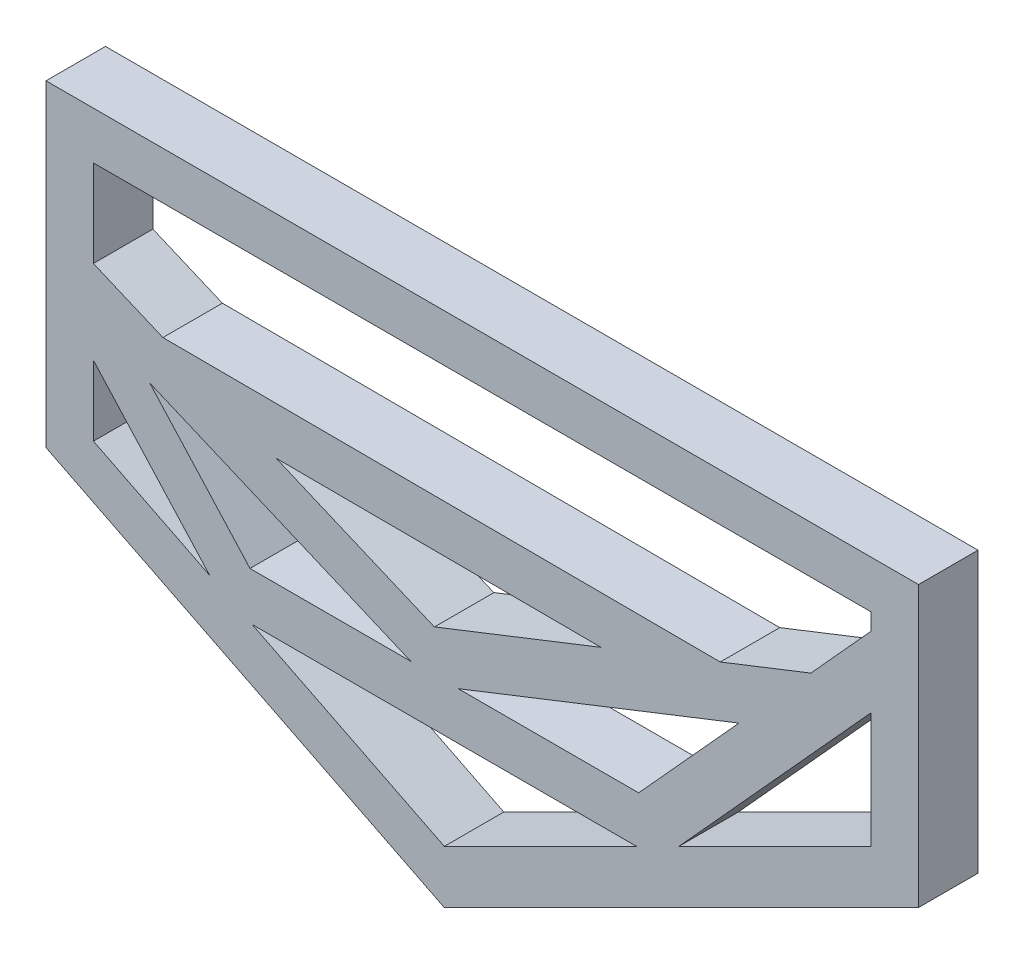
ISO-10303-21;
HEADER;
FILE_DESCRIPTION(('STEP AP214'),'2;1');
FILE_NAME('part.step','',(''),(''),'','','');
FILE_SCHEMA(('AUTOMOTIVE_DESIGN { 1 0 10303 214 1 1 1 1 }'));
ENDSEC;
DATA;
#1=APPLICATION_CONTEXT('core data for automotive mechanical design processes');
#2=APPLICATION_PROTOCOL_DEFINITION('international standard','automotive_design',2000,#1);
#3=PRODUCT_CONTEXT('',#1,'mechanical');
#4=PRODUCT('Part','Part','',(#3));
#5=PRODUCT_RELATED_PRODUCT_CATEGORY('part','',(#4));
#6=PRODUCT_DEFINITION_FORMATION('','',#4);
#7=PRODUCT_DEFINITION_CONTEXT('part definition',#1,'design');
#8=PRODUCT_DEFINITION('design','',#6,#7);
#9=PRODUCT_DEFINITION_SHAPE('','',#8);
#10=(LENGTH_UNIT() NAMED_UNIT(*) SI_UNIT(.MILLI.,.METRE.));
#11=(NAMED_UNIT(*) PLANE_ANGLE_UNIT() SI_UNIT($,.RADIAN.));
#12=(NAMED_UNIT(*) SI_UNIT($,.STERADIAN.) SOLID_ANGLE_UNIT());
#13=UNCERTAINTY_MEASURE_WITH_UNIT(LENGTH_MEASURE(1.E-05),#10,'distance_accuracy_value','');
#14=(GEOMETRIC_REPRESENTATION_CONTEXT(3) GLOBAL_UNCERTAINTY_ASSIGNED_CONTEXT((#13)) GLOBAL_UNIT_ASSIGNED_CONTEXT((#10,
#11,#12)) REPRESENTATION_CONTEXT('',''));
#15=CARTESIAN_POINT('',(0.,0.,0.));
#16=DIRECTION('',(0.,0.,1.));
#17=DIRECTION('',(1.,0.,0.));
#18=AXIS2_PLACEMENT_3D('',#15,#16,#17);
#19=CARTESIAN_POINT('',(0.,0.,19.));
#20=DIRECTION('',(0.,0.,-1.));
#21=DIRECTION('',(-1.,0.,0.));
#22=AXIS2_PLACEMENT_3D('',#19,#20,#21);
#23=PLANE('',#22);
#24=DIRECTION('',(0.671904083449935,-0.740638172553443,0.));
#25=VECTOR('',#24,1.);
#26=CARTESIAN_POINT('',(-49.8871765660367,53.1441461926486,19.));
#27=LINE('',#26,#25);
#28=CARTESIAN_POINT('',(-49.8871765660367,53.1441461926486,19.));
#29=VERTEX_POINT('',#28);
#30=CARTESIAN_POINT('',(-17.8631863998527,17.844182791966,19.));
#31=VERTEX_POINT('',#30);
#32=EDGE_CURVE('E265',#29,#31,#27,.T.);
#33=ORIENTED_EDGE('',*,*,#32,.F.);
#34=DIRECTION('',(-0.920875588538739,0.389856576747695,0.));
#35=VECTOR('',#34,1.);
#36=CARTESIAN_POINT('',(-49.8871765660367,53.1441461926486,19.));
#37=LINE('',#36,#35);
#38=CARTESIAN_POINT('',(33.4944476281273,17.8441827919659,19.));
#39=VERTEX_POINT('',#38);
#40=EDGE_CURVE('E271',#39,#29,#37,.T.);
#41=ORIENTED_EDGE('',*,*,#40,.F.);
#42=DIRECTION('',(1.,0.,0.));
#43=VECTOR('',#42,1.);
#44=CARTESIAN_POINT('',(-17.8631863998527,17.844182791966,19.));
#45=LINE('',#44,#43);
#46=EDGE_CURVE('E267',#31,#39,#45,.T.);
#47=ORIENTED_EDGE('',*,*,#46,.F.);
#48=EDGE_LOOP('',(#33,#41,#47));
#49=FACE_BOUND('',#48,.T.);
#50=DIRECTION('',(0.894427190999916,-0.447213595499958,0.));
#51=VECTOR('',#50,1.);
#52=CARTESIAN_POINT('',(-17.1707653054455,2.70132559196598,19.));
#53=LINE('',#52,#51);
#54=CARTESIAN_POINT('',(-17.1707653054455,2.70132559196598,19.));
#55=VERTEX_POINT('',#54);
#56=CARTESIAN_POINT('',(44.2000004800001,-27.9840573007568,19.));
#57=VERTEX_POINT('',#56);
#58=EDGE_CURVE('E320',#55,#57,#53,.T.);
#59=ORIENTED_EDGE('',*,*,#58,.F.);
#60=DIRECTION('',(-1.,0.,0.));
#61=VECTOR('',#60,1.);
#62=CARTESIAN_POINT('',(-17.1707653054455,2.70132559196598,19.));
#63=LINE('',#62,#61);
#64=CARTESIAN_POINT('',(105.570766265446,2.70132559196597,19.));
#65=VERTEX_POINT('',#64);
#66=EDGE_CURVE('E326',#65,#55,#63,.T.);
#67=ORIENTED_EDGE('',*,*,#66,.F.);
#68=DIRECTION('',(0.894427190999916,0.447213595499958,0.));
#69=VECTOR('',#68,1.);
#70=CARTESIAN_POINT('',(44.2000004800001,-27.9840573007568,19.));
#71=LINE('',#70,#69);
#72=EDGE_CURVE('E322',#57,#65,#71,.T.);
#73=ORIENTED_EDGE('',*,*,#72,.F.);
#74=EDGE_LOOP('',(#59,#67,#73));
#75=FACE_BOUND('',#74,.T.);
#76=DIRECTION('',(-0.671904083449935,0.740638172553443,0.));
#77=VECTOR('',#76,1.);
#78=CARTESIAN_POINT('',(-67.8571427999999,50.4151640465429,19.));
#79=LINE('',#78,#77);
#80=CARTESIAN_POINT('',(-30.7149485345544,9.47341720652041,19.));
#81=VERTEX_POINT('',#80);
#82=CARTESIAN_POINT('',(-67.8571427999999,50.4151640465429,19.));
#83=VERTEX_POINT('',#82);
#84=EDGE_CURVE('E368',#81,#83,#79,.T.);
#85=ORIENTED_EDGE('',*,*,#84,.F.);
#86=DIRECTION('',(0.894427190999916,-0.447213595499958,0.));
#87=VECTOR('',#86,1.);
#88=CARTESIAN_POINT('',(-67.8571427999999,28.0445143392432,19.));
#89=LINE('',#88,#87);
#90=CARTESIAN_POINT('',(-67.8571427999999,28.0445143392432,19.));
#91=VERTEX_POINT('',#90);
#92=EDGE_CURVE('E374',#91,#81,#89,.T.);
#93=ORIENTED_EDGE('',*,*,#92,.F.);
#94=DIRECTION('',(0.,-1.,0.));
#95=VECTOR('',#94,1.);
#96=CARTESIAN_POINT('',(-67.8571427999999,50.4151640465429,19.));
#97=LINE('',#96,#95);
#98=EDGE_CURVE('E370',#83,#91,#97,.T.);
#99=ORIENTED_EDGE('',*,*,#98,.F.);
#100=EDGE_LOOP('',(#85,#93,#99));
#101=FACE_BOUND('',#100,.T.);
#102=DIRECTION('',(-1.,0.,0.));
#103=VECTOR('',#102,1.);
#104=CARTESIAN_POINT('',(-82.9999999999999,120.142857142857,19.));
#105=LINE('',#104,#103);
#106=CARTESIAN_POINT('',(195.62857248,120.142857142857,19.));
#107=VERTEX_POINT('',#106);
#108=CARTESIAN_POINT('',(-82.9999999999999,120.142857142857,19.));
#109=VERTEX_POINT('',#108);
#110=EDGE_CURVE('E444',#107,#109,#105,.T.);
#111=ORIENTED_EDGE('',*,*,#110,.T.);
#112=DIRECTION('',(0.,-1.,0.));
#113=VECTOR('',#112,1.);
#114=CARTESIAN_POINT('',(-82.9999999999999,120.142857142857,19.));
#115=LINE('',#114,#113);
#116=CARTESIAN_POINT('',(-82.9999999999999,18.6857139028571,19.));
#117=VERTEX_POINT('',#116);
#118=EDGE_CURVE('E447',#109,#117,#115,.T.);
#119=ORIENTED_EDGE('',*,*,#118,.T.);
#120=DIRECTION('',(0.894427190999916,-0.447213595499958,0.));
#121=VECTOR('',#120,1.);
#122=CARTESIAN_POINT('',(-82.9999999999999,18.6857139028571,19.));
#123=LINE('',#122,#121);
#124=CARTESIAN_POINT('',(44.2000004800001,-44.9142863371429,19.));
#125=VERTEX_POINT('',#124);
#126=EDGE_CURVE('E450',#117,#125,#123,.T.);
#127=ORIENTED_EDGE('',*,*,#126,.T.);
#128=DIRECTION('',(0.894427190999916,0.447213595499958,0.));
#129=VECTOR('',#128,1.);
#130=CARTESIAN_POINT('',(44.2000004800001,-44.9142863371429,19.));
#131=LINE('',#130,#129);
#132=CARTESIAN_POINT('',(195.62857248,30.7999996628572,19.));
#133=VERTEX_POINT('',#132);
#134=EDGE_CURVE('E452',#125,#133,#131,.T.);
#135=ORIENTED_EDGE('',*,*,#134,.T.);
#136=DIRECTION('',(0.,1.,0.));
#137=VECTOR('',#136,1.);
#138=CARTESIAN_POINT('',(195.62857248,120.142857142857,19.));
#139=LINE('',#138,#137);
#140=EDGE_CURVE('E454',#133,#107,#139,.T.);
#141=ORIENTED_EDGE('',*,*,#140,.T.);
#142=EDGE_LOOP('',(#111,#119,#127,#135,#141));
#143=FACE_BOUND('',#142,.T.);
#144=DIRECTION('',(-1.,0.,0.));
#145=VECTOR('',#144,1.);
#146=CARTESIAN_POINT('',(-67.8571427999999,104.999999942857,19.));
#147=LINE('',#146,#145);
#148=CARTESIAN_POINT('',(180.48571528,104.999999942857,19.));
#149=VERTEX_POINT('',#148);
#150=CARTESIAN_POINT('',(-67.8571427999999,104.999999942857,19.));
#151=VERTEX_POINT('',#150);
#152=EDGE_CURVE('E392',#149,#151,#147,.T.);
#153=ORIENTED_EDGE('',*,*,#152,.F.);
#154=DIRECTION('',(0.,1.,0.));
#155=VECTOR('',#154,1.);
#156=CARTESIAN_POINT('',(180.48571528,104.999999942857,19.));
#157=LINE('',#156,#155);
#158=CARTESIAN_POINT('',(180.48571528,99.659487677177,19.));
#159=VERTEX_POINT('',#158);
#160=EDGE_CURVE('E406',#159,#149,#157,.T.);
#161=ORIENTED_EDGE('',*,*,#160,.F.);
#162=DIRECTION('',(0.671904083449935,0.740638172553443,0.));
#163=VECTOR('',#162,1.);
#164=CARTESIAN_POINT('',(161.256065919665,78.4626938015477,19.));
#165=LINE('',#164,#163);
#166=CARTESIAN_POINT('',(161.256065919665,78.4626938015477,19.));
#167=VERTEX_POINT('',#166);
#168=EDGE_CURVE('E403',#167,#159,#165,.T.);
#169=ORIENTED_EDGE('',*,*,#168,.F.);
#170=DIRECTION('',(0.930467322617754,0.366374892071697,0.));
#171=VECTOR('',#170,1.);
#172=CARTESIAN_POINT('',(132.322852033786,67.0701356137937,19.));
#173=LINE('',#172,#171);
#174=CARTESIAN_POINT('',(132.322852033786,67.0701356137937,19.));
#175=VERTEX_POINT('',#174);
#176=EDGE_CURVE('E401',#175,#167,#173,.T.);
#177=ORIENTED_EDGE('',*,*,#176,.F.);
#178=DIRECTION('',(0.999991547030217,-0.00411167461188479,0.));
#179=VECTOR('',#178,1.);
#180=CARTESIAN_POINT('',(-45.6681552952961,67.8019829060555,19.));
#181=LINE('',#180,#179);
#182=CARTESIAN_POINT('',(-45.6681552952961,67.8019829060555,19.));
#183=VERTEX_POINT('',#182);
#184=EDGE_CURVE('E399',#183,#175,#181,.T.);
#185=ORIENTED_EDGE('',*,*,#184,.F.);
#186=DIRECTION('',(0.920875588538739,-0.389856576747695,0.));
#187=VECTOR('',#186,1.);
#188=CARTESIAN_POINT('',(-67.8571427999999,77.195784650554,19.));
#189=LINE('',#188,#187);
#190=CARTESIAN_POINT('',(-67.8571427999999,77.195784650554,19.));
#191=VERTEX_POINT('',#190);
#192=EDGE_CURVE('E397',#191,#183,#189,.T.);
#193=ORIENTED_EDGE('',*,*,#192,.F.);
#194=DIRECTION('',(0.,-1.,0.));
#195=VECTOR('',#194,1.);
#196=CARTESIAN_POINT('',(-67.8571427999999,104.999999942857,19.));
#197=LINE('',#196,#195);
#198=EDGE_CURVE('E394',#151,#191,#197,.T.);
#199=ORIENTED_EDGE('',*,*,#198,.F.);
#200=EDGE_LOOP('',(#153,#161,#169,#177,#185,#193,#199));
#201=FACE_BOUND('',#200,.T.);
#202=DIRECTION('',(0.,1.,0.));
#203=VECTOR('',#202,1.);
#204=CARTESIAN_POINT('',(180.48571528,77.1222571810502,19.));
#205=LINE('',#204,#203);
#206=CARTESIAN_POINT('',(180.48571528,40.1588000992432,19.));
#207=VERTEX_POINT('',#206);
#208=CARTESIAN_POINT('',(180.48571528,77.1222571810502,19.));
#209=VERTEX_POINT('',#208);
#210=EDGE_CURVE('E344',#207,#209,#205,.T.);
#211=ORIENTED_EDGE('',*,*,#210,.F.);
#212=DIRECTION('',(0.894427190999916,0.447213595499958,0.));
#213=VECTOR('',#212,1.);
#214=CARTESIAN_POINT('',(119.114949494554,9.47341720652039,19.));
#215=LINE('',#214,#213);
#216=CARTESIAN_POINT('',(119.114949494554,9.47341720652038,19.));
#217=VERTEX_POINT('',#216);
#218=EDGE_CURVE('E350',#217,#207,#215,.T.);
#219=ORIENTED_EDGE('',*,*,#218,.F.);
#220=DIRECTION('',(-0.671904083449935,-0.740638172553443,0.));
#221=VECTOR('',#220,1.);
#222=CARTESIAN_POINT('',(119.114949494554,9.47341720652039,19.));
#223=LINE('',#222,#221);
#224=EDGE_CURVE('E346',#209,#217,#223,.T.);
#225=ORIENTED_EDGE('',*,*,#224,.F.);
#226=EDGE_LOOP('',(#211,#219,#225));
#227=FACE_BOUND('',#226,.T.);
#228=DIRECTION('',(0.930467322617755,0.366374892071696,0.));
#229=VECTOR('',#228,1.);
#230=CARTESIAN_POINT('',(41.0658762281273,31.1373695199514,19.));
#231=LINE('',#230,#229);
#232=CARTESIAN_POINT('',(41.0658762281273,31.1373695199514,19.));
#233=VERTEX_POINT('',#232);
#234=CARTESIAN_POINT('',(94.2622736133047,52.0836444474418,19.));
#235=VERTEX_POINT('',#234);
#236=EDGE_CURVE('E289',#233,#235,#231,.T.);
#237=ORIENTED_EDGE('',*,*,#236,.F.);
#238=DIRECTION('',(-2.54144745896E-13,1.,0.));
#239=VECTOR('',#238,1.);
#240=CARTESIAN_POINT('',(41.0658762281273,31.1373695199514,19.));
#241=LINE('',#240,#239);
#242=CARTESIAN_POINT('',(41.0658762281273,31.0827636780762,19.));
#243=VERTEX_POINT('',#242);
#244=EDGE_CURVE('E297',#243,#233,#241,.T.);
#245=ORIENTED_EDGE('',*,*,#244,.F.);
#246=DIRECTION('',(0.920875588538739,-0.389856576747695,0.));
#247=VECTOR('',#246,1.);
#248=CARTESIAN_POINT('',(-9.54828572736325,52.5104832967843,19.));
#249=LINE('',#248,#247);
#250=CARTESIAN_POINT('',(-9.54828572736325,52.5104832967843,19.));
#251=VERTEX_POINT('',#250);
#252=EDGE_CURVE('E294',#251,#243,#249,.T.);
#253=ORIENTED_EDGE('',*,*,#252,.F.);
#254=DIRECTION('',(-0.999991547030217,0.00411167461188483,0.));
#255=VECTOR('',#254,1.);
#256=CARTESIAN_POINT('',(-9.54828572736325,52.5104832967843,19.));
#257=LINE('',#256,#255);
#258=EDGE_CURVE('E291',#235,#251,#257,.T.);
#259=ORIENTED_EDGE('',*,*,#258,.F.);
#260=EDGE_LOOP('',(#237,#245,#253,#259));
#261=FACE_BOUND('',#260,.T.);
#262=DIRECTION('',(1.,0.,0.));
#263=VECTOR('',#262,1.);
#264=CARTESIAN_POINT('',(48.6373048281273,17.844182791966,19.));
#265=LINE('',#264,#263);
#266=CARTESIAN_POINT('',(48.6373048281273,17.844182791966,19.));
#267=VERTEX_POINT('',#266);
#268=CARTESIAN_POINT('',(106.263187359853,17.844182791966,19.));
#269=VERTEX_POINT('',#268);
#270=EDGE_CURVE('E238',#267,#269,#265,.T.);
#271=ORIENTED_EDGE('',*,*,#270,.F.);
#272=DIRECTION('',(-0.930467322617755,-0.366374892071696,0.));
#273=VECTOR('',#272,1.);
#274=CARTESIAN_POINT('',(48.6373048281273,17.844182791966,19.));
#275=LINE('',#274,#273);
#276=CARTESIAN_POINT('',(138.287177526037,53.1441461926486,19.));
#277=VERTEX_POINT('',#276);
#278=EDGE_CURVE('E255',#277,#267,#275,.T.);
#279=ORIENTED_EDGE('',*,*,#278,.F.);
#280=DIRECTION('',(0.671904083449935,0.740638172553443,0.));
#281=VECTOR('',#280,1.);
#282=CARTESIAN_POINT('',(106.263187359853,17.844182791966,19.));
#283=LINE('',#282,#281);
#284=EDGE_CURVE('E246',#269,#277,#283,.T.);
#285=ORIENTED_EDGE('',*,*,#284,.F.);
#286=EDGE_LOOP('',(#271,#279,#285));
#287=FACE_BOUND('',#286,.T.);
#288=ADVANCED_FACE('F35',(#49,#75,#101,#143,#201,#227,#261,#287),#23,.F.);
#289=CARTESIAN_POINT('',(0.,0.,0.));
#290=DIRECTION('',(0.,0.,-1.));
#291=DIRECTION('',(-1.,0.,0.));
#292=AXIS2_PLACEMENT_3D('',#289,#290,#291);
#293=PLANE('',#292);
#294=DIRECTION('',(-1.,0.,0.));
#295=VECTOR('',#294,1.);
#296=CARTESIAN_POINT('',(-82.9999999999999,120.142857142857,0.));
#297=LINE('',#296,#295);
#298=CARTESIAN_POINT('',(195.62857248,120.142857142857,0.));
#299=VERTEX_POINT('',#298);
#300=CARTESIAN_POINT('',(-82.9999999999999,120.142857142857,0.));
#301=VERTEX_POINT('',#300);
#302=EDGE_CURVE('E443',#299,#301,#297,.T.);
#303=ORIENTED_EDGE('',*,*,#302,.F.);
#304=DIRECTION('',(0.,1.,0.));
#305=VECTOR('',#304,1.);
#306=CARTESIAN_POINT('',(195.62857248,120.142857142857,0.));
#307=LINE('',#306,#305);
#308=CARTESIAN_POINT('',(195.62857248,30.7999996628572,0.));
#309=VERTEX_POINT('',#308);
#310=EDGE_CURVE('E448',#309,#299,#307,.T.);
#311=ORIENTED_EDGE('',*,*,#310,.F.);
#312=DIRECTION('',(0.894427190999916,0.447213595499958,0.));
#313=VECTOR('',#312,1.);
#314=CARTESIAN_POINT('',(44.2000004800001,-44.9142863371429,0.));
#315=LINE('',#314,#313);
#316=CARTESIAN_POINT('',(44.2000004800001,-44.9142863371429,0.));
#317=VERTEX_POINT('',#316);
#318=EDGE_CURVE('E463',#317,#309,#315,.T.);
#319=ORIENTED_EDGE('',*,*,#318,.F.);
#320=DIRECTION('',(0.894427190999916,-0.447213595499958,0.));
#321=VECTOR('',#320,1.);
#322=CARTESIAN_POINT('',(-82.9999999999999,18.6857139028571,0.));
#323=LINE('',#322,#321);
#324=CARTESIAN_POINT('',(-82.9999999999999,18.6857139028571,0.));
#325=VERTEX_POINT('',#324);
#326=EDGE_CURVE('E461',#325,#317,#323,.T.);
#327=ORIENTED_EDGE('',*,*,#326,.F.);
#328=DIRECTION('',(0.,-1.,0.));
#329=VECTOR('',#328,1.);
#330=CARTESIAN_POINT('',(-82.9999999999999,120.142857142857,0.));
#331=LINE('',#330,#329);
#332=EDGE_CURVE('E459',#301,#325,#331,.T.);
#333=ORIENTED_EDGE('',*,*,#332,.F.);
#334=EDGE_LOOP('',(#303,#311,#319,#327,#333));
#335=FACE_BOUND('',#334,.T.);
#336=DIRECTION('',(0.,1.,0.));
#337=VECTOR('',#336,1.);
#338=CARTESIAN_POINT('',(180.48571528,104.999999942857,0.));
#339=LINE('',#338,#337);
#340=CARTESIAN_POINT('',(180.48571528,99.659487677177,0.));
#341=VERTEX_POINT('',#340);
#342=CARTESIAN_POINT('',(180.48571528,104.999999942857,0.));
#343=VERTEX_POINT('',#342);
#344=EDGE_CURVE('E395',#341,#343,#339,.T.);
#345=ORIENTED_EDGE('',*,*,#344,.T.);
#346=DIRECTION('',(-1.,0.,0.));
#347=VECTOR('',#346,1.);
#348=CARTESIAN_POINT('',(-67.8571427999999,104.999999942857,0.));
#349=LINE('',#348,#347);
#350=CARTESIAN_POINT('',(-67.8571427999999,104.999999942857,0.));
#351=VERTEX_POINT('',#350);
#352=EDGE_CURVE('E391',#343,#351,#349,.T.);
#353=ORIENTED_EDGE('',*,*,#352,.T.);
#354=DIRECTION('',(0.,-1.,0.));
#355=VECTOR('',#354,1.);
#356=CARTESIAN_POINT('',(-67.8571427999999,104.999999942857,0.));
#357=LINE('',#356,#355);
#358=CARTESIAN_POINT('',(-67.8571427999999,77.195784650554,0.));
#359=VERTEX_POINT('',#358);
#360=EDGE_CURVE('E411',#351,#359,#357,.T.);
#361=ORIENTED_EDGE('',*,*,#360,.T.);
#362=DIRECTION('',(0.920875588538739,-0.389856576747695,0.));
#363=VECTOR('',#362,1.);
#364=CARTESIAN_POINT('',(-67.8571427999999,77.195784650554,0.));
#365=LINE('',#364,#363);
#366=CARTESIAN_POINT('',(-45.6681552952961,67.8019829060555,0.));
#367=VERTEX_POINT('',#366);
#368=EDGE_CURVE('E414',#359,#367,#365,.T.);
#369=ORIENTED_EDGE('',*,*,#368,.T.);
#370=DIRECTION('',(0.999991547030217,-0.00411167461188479,0.));
#371=VECTOR('',#370,1.);
#372=CARTESIAN_POINT('',(-45.6681552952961,67.8019829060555,0.));
#373=LINE('',#372,#371);
#374=CARTESIAN_POINT('',(132.322852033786,67.0701356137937,0.));
#375=VERTEX_POINT('',#374);
#376=EDGE_CURVE('E417',#367,#375,#373,.T.);
#377=ORIENTED_EDGE('',*,*,#376,.T.);
#378=DIRECTION('',(0.930467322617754,0.366374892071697,0.));
#379=VECTOR('',#378,1.);
#380=CARTESIAN_POINT('',(132.322852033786,67.0701356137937,0.));
#381=LINE('',#380,#379);
#382=CARTESIAN_POINT('',(161.256065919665,78.4626938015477,0.));
#383=VERTEX_POINT('',#382);
#384=EDGE_CURVE('E420',#375,#383,#381,.T.);
#385=ORIENTED_EDGE('',*,*,#384,.T.);
#386=DIRECTION('',(0.671904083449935,0.740638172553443,0.));
#387=VECTOR('',#386,1.);
#388=CARTESIAN_POINT('',(161.256065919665,78.4626938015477,0.));
#389=LINE('',#388,#387);
#390=EDGE_CURVE('E423',#383,#341,#389,.T.);
#391=ORIENTED_EDGE('',*,*,#390,.T.);
#392=EDGE_LOOP('',(#345,#353,#361,#369,#377,#385,#391));
#393=FACE_BOUND('',#392,.T.);
#394=DIRECTION('',(0.894427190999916,-0.447213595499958,0.));
#395=VECTOR('',#394,1.);
#396=CARTESIAN_POINT('',(-67.8571427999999,28.0445143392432,0.));
#397=LINE('',#396,#395);
#398=CARTESIAN_POINT('',(-67.8571427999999,28.0445143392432,0.));
#399=VERTEX_POINT('',#398);
#400=CARTESIAN_POINT('',(-30.7149485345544,9.4734172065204,0.));
#401=VERTEX_POINT('',#400);
#402=EDGE_CURVE('E371',#399,#401,#397,.T.);
#403=ORIENTED_EDGE('',*,*,#402,.T.);
#404=DIRECTION('',(-0.671904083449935,0.740638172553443,0.));
#405=VECTOR('',#404,1.);
#406=CARTESIAN_POINT('',(-67.8571427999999,50.4151640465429,0.));
#407=LINE('',#406,#405);
#408=CARTESIAN_POINT('',(-67.8571427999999,50.4151640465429,0.));
#409=VERTEX_POINT('',#408);
#410=EDGE_CURVE('E367',#401,#409,#407,.T.);
#411=ORIENTED_EDGE('',*,*,#410,.T.);
#412=DIRECTION('',(0.,-1.,0.));
#413=VECTOR('',#412,1.);
#414=CARTESIAN_POINT('',(-67.8571427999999,50.4151640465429,0.));
#415=LINE('',#414,#413);
#416=EDGE_CURVE('E379',#409,#399,#415,.T.);
#417=ORIENTED_EDGE('',*,*,#416,.T.);
#418=EDGE_LOOP('',(#403,#411,#417));
#419=FACE_BOUND('',#418,.T.);
#420=DIRECTION('',(0.894427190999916,0.447213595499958,0.));
#421=VECTOR('',#420,1.);
#422=CARTESIAN_POINT('',(119.114949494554,9.47341720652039,0.));
#423=LINE('',#422,#421);
#424=CARTESIAN_POINT('',(119.114949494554,9.47341720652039,0.));
#425=VERTEX_POINT('',#424);
#426=CARTESIAN_POINT('',(180.48571528,40.1588000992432,0.));
#427=VERTEX_POINT('',#426);
#428=EDGE_CURVE('E347',#425,#427,#423,.T.);
#429=ORIENTED_EDGE('',*,*,#428,.T.);
#430=DIRECTION('',(0.,1.,0.));
#431=VECTOR('',#430,1.);
#432=CARTESIAN_POINT('',(180.48571528,77.1222571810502,0.));
#433=LINE('',#432,#431);
#434=CARTESIAN_POINT('',(180.48571528,77.1222571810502,0.));
#435=VERTEX_POINT('',#434);
#436=EDGE_CURVE('E343',#427,#435,#433,.T.);
#437=ORIENTED_EDGE('',*,*,#436,.T.);
#438=DIRECTION('',(-0.671904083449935,-0.740638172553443,0.));
#439=VECTOR('',#438,1.);
#440=CARTESIAN_POINT('',(119.114949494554,9.47341720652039,0.));
#441=LINE('',#440,#439);
#442=EDGE_CURVE('E355',#435,#425,#441,.T.);
#443=ORIENTED_EDGE('',*,*,#442,.T.);
#444=EDGE_LOOP('',(#429,#437,#443));
#445=FACE_BOUND('',#444,.T.);
#446=DIRECTION('',(-1.,0.,0.));
#447=VECTOR('',#446,1.);
#448=CARTESIAN_POINT('',(-17.1707653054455,2.70132559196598,0.));
#449=LINE('',#448,#447);
#450=CARTESIAN_POINT('',(105.570766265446,2.70132559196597,0.));
#451=VERTEX_POINT('',#450);
#452=CARTESIAN_POINT('',(-17.1707653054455,2.70132559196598,0.));
#453=VERTEX_POINT('',#452);
#454=EDGE_CURVE('E323',#451,#453,#449,.T.);
#455=ORIENTED_EDGE('',*,*,#454,.T.);
#456=DIRECTION('',(0.894427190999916,-0.447213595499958,0.));
#457=VECTOR('',#456,1.);
#458=CARTESIAN_POINT('',(-17.1707653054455,2.70132559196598,0.));
#459=LINE('',#458,#457);
#460=CARTESIAN_POINT('',(44.2000004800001,-27.9840573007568,0.));
#461=VERTEX_POINT('',#460);
#462=EDGE_CURVE('E319',#453,#461,#459,.T.);
#463=ORIENTED_EDGE('',*,*,#462,.T.);
#464=DIRECTION('',(0.894427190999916,0.447213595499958,0.));
#465=VECTOR('',#464,1.);
#466=CARTESIAN_POINT('',(44.2000004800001,-27.9840573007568,0.));
#467=LINE('',#466,#465);
#468=EDGE_CURVE('E331',#461,#451,#467,.T.);
#469=ORIENTED_EDGE('',*,*,#468,.T.);
#470=EDGE_LOOP('',(#455,#463,#469));
#471=FACE_BOUND('',#470,.T.);
#472=DIRECTION('',(-2.54144745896E-13,1.,0.));
#473=VECTOR('',#472,1.);
#474=CARTESIAN_POINT('',(41.0658762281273,31.1373695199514,0.));
#475=LINE('',#474,#473);
#476=CARTESIAN_POINT('',(41.0658762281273,31.0827636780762,0.));
#477=VERTEX_POINT('',#476);
#478=CARTESIAN_POINT('',(41.0658762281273,31.1373695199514,0.));
#479=VERTEX_POINT('',#478);
#480=EDGE_CURVE('E292',#477,#479,#475,.T.);
#481=ORIENTED_EDGE('',*,*,#480,.T.);
#482=DIRECTION('',(0.930467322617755,0.366374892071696,0.));
#483=VECTOR('',#482,1.);
#484=CARTESIAN_POINT('',(41.0658762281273,31.1373695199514,0.));
#485=LINE('',#484,#483);
#486=CARTESIAN_POINT('',(94.2622736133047,52.0836444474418,0.));
#487=VERTEX_POINT('',#486);
#488=EDGE_CURVE('E288',#479,#487,#485,.T.);
#489=ORIENTED_EDGE('',*,*,#488,.T.);
#490=DIRECTION('',(-0.999991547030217,0.00411167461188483,0.));
#491=VECTOR('',#490,1.);
#492=CARTESIAN_POINT('',(-9.54828572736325,52.5104832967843,0.));
#493=LINE('',#492,#491);
#494=CARTESIAN_POINT('',(-9.54828572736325,52.5104832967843,0.));
#495=VERTEX_POINT('',#494);
#496=EDGE_CURVE('E302',#487,#495,#493,.T.);
#497=ORIENTED_EDGE('',*,*,#496,.T.);
#498=DIRECTION('',(0.920875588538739,-0.389856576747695,0.));
#499=VECTOR('',#498,1.);
#500=CARTESIAN_POINT('',(-9.54828572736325,52.5104832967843,0.));
#501=LINE('',#500,#499);
#502=EDGE_CURVE('E305',#495,#477,#501,.T.);
#503=ORIENTED_EDGE('',*,*,#502,.T.);
#504=EDGE_LOOP('',(#481,#489,#497,#503));
#505=FACE_BOUND('',#504,.T.);
#506=DIRECTION('',(-0.920875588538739,0.389856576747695,0.));
#507=VECTOR('',#506,1.);
#508=CARTESIAN_POINT('',(-49.8871765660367,53.1441461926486,0.));
#509=LINE('',#508,#507);
#510=CARTESIAN_POINT('',(33.4944476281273,17.844182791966,0.));
#511=VERTEX_POINT('',#510);
#512=CARTESIAN_POINT('',(-49.8871765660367,53.1441461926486,0.));
#513=VERTEX_POINT('',#512);
#514=EDGE_CURVE('E268',#511,#513,#509,.T.);
#515=ORIENTED_EDGE('',*,*,#514,.T.);
#516=DIRECTION('',(0.671904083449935,-0.740638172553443,0.));
#517=VECTOR('',#516,1.);
#518=CARTESIAN_POINT('',(-49.8871765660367,53.1441461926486,0.));
#519=LINE('',#518,#517);
#520=CARTESIAN_POINT('',(-17.8631863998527,17.844182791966,0.));
#521=VERTEX_POINT('',#520);
#522=EDGE_CURVE('E253',#513,#521,#519,.T.);
#523=ORIENTED_EDGE('',*,*,#522,.T.);
#524=DIRECTION('',(1.,0.,0.));
#525=VECTOR('',#524,1.);
#526=CARTESIAN_POINT('',(-17.8631863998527,17.844182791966,0.));
#527=LINE('',#526,#525);
#528=EDGE_CURVE('E276',#521,#511,#527,.T.);
#529=ORIENTED_EDGE('',*,*,#528,.T.);
#530=EDGE_LOOP('',(#515,#523,#529));
#531=FACE_BOUND('',#530,.T.);
#532=DIRECTION('',(-0.930467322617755,-0.366374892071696,0.));
#533=VECTOR('',#532,1.);
#534=CARTESIAN_POINT('',(48.6373048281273,17.844182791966,0.));
#535=LINE('',#534,#533);
#536=CARTESIAN_POINT('',(138.287177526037,53.1441461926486,0.));
#537=VERTEX_POINT('',#536);
#538=CARTESIAN_POINT('',(48.6373048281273,17.844182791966,0.));
#539=VERTEX_POINT('',#538);
#540=EDGE_CURVE('E247',#537,#539,#535,.T.);
#541=ORIENTED_EDGE('',*,*,#540,.T.);
#542=DIRECTION('',(1.,0.,0.));
#543=VECTOR('',#542,1.);
#544=CARTESIAN_POINT('',(48.6373048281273,17.844182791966,0.));
#545=LINE('',#544,#543);
#546=CARTESIAN_POINT('',(106.263187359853,17.844182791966,0.));
#547=VERTEX_POINT('',#546);
#548=EDGE_CURVE('E58',#539,#547,#545,.T.);
#549=ORIENTED_EDGE('',*,*,#548,.T.);
#550=DIRECTION('',(0.671904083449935,0.740638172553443,0.));
#551=VECTOR('',#550,1.);
#552=CARTESIAN_POINT('',(106.263187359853,17.844182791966,0.));
#553=LINE('',#552,#551);
#554=EDGE_CURVE('E252',#547,#537,#553,.T.);
#555=ORIENTED_EDGE('',*,*,#554,.T.);
#556=EDGE_LOOP('',(#541,#549,#555));
#557=FACE_BOUND('',#556,.T.);
#558=ADVANCED_FACE('F484',(#335,#393,#419,#445,#471,#505,#531,#557),#293,.T.);
#559=CARTESIAN_POINT('',(-82.9999999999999,120.142857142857,19.));
#560=DIRECTION('',(0.,-1.,0.));
#561=DIRECTION('',(0.,0.,-1.));
#562=AXIS2_PLACEMENT_3D('',#559,#560,#561);
#563=PLANE('',#562);
#564=ORIENTED_EDGE('',*,*,#302,.T.);
#565=DIRECTION('',(0.,0.,-1.));
#566=VECTOR('',#565,1.);
#567=CARTESIAN_POINT('',(-82.9999999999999,120.142857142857,19.));
#568=LINE('',#567,#566);
#569=EDGE_CURVE('E11',#109,#301,#568,.T.);
#570=ORIENTED_EDGE('',*,*,#569,.F.);
#571=ORIENTED_EDGE('',*,*,#110,.F.);
#572=DIRECTION('',(0.,0.,-1.));
#573=VECTOR('',#572,1.);
#574=CARTESIAN_POINT('',(195.62857248,120.142857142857,19.));
#575=LINE('',#574,#573);
#576=EDGE_CURVE('E456',#107,#299,#575,.T.);
#577=ORIENTED_EDGE('',*,*,#576,.T.);
#578=EDGE_LOOP('',(#564,#570,#571,#577));
#579=FACE_BOUND('',#578,.T.);
#580=ADVANCED_FACE('F37',(#579),#563,.F.);
#581=CARTESIAN_POINT('',(-82.9999999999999,120.142857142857,19.));
#582=DIRECTION('',(1.,0.,0.));
#583=DIRECTION('',(0.,0.,-1.));
#584=AXIS2_PLACEMENT_3D('',#581,#582,#583);
#585=PLANE('',#584);
#586=ORIENTED_EDGE('',*,*,#332,.T.);
#587=DIRECTION('',(0.,0.,-1.));
#588=VECTOR('',#587,1.);
#589=CARTESIAN_POINT('',(-82.9999999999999,18.6857139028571,19.));
#590=LINE('',#589,#588);
#591=EDGE_CURVE('E43',#117,#325,#590,.T.);
#592=ORIENTED_EDGE('',*,*,#591,.F.);
#593=ORIENTED_EDGE('',*,*,#118,.F.);
#594=ORIENTED_EDGE('',*,*,#569,.T.);
#595=EDGE_LOOP('',(#586,#592,#593,#594));
#596=FACE_BOUND('',#595,.T.);
#597=ADVANCED_FACE('F499',(#596),#585,.F.);
#598=CARTESIAN_POINT('',(-82.9999999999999,18.6857139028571,19.));
#599=DIRECTION('',(0.447213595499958,0.894427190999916,0.));
#600=DIRECTION('',(-0.894427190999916,0.447213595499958,0.));
#601=AXIS2_PLACEMENT_3D('',#598,#599,#600);
#602=PLANE('',#601);
#603=ORIENTED_EDGE('',*,*,#326,.T.);
#604=DIRECTION('',(0.,0.,-1.));
#605=VECTOR('',#604,1.);
#606=CARTESIAN_POINT('',(44.2000004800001,-44.9142863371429,19.));
#607=LINE('',#606,#605);
#608=EDGE_CURVE('E471',#125,#317,#607,.T.);
#609=ORIENTED_EDGE('',*,*,#608,.F.);
#610=ORIENTED_EDGE('',*,*,#126,.F.);
#611=ORIENTED_EDGE('',*,*,#591,.T.);
#612=EDGE_LOOP('',(#603,#609,#610,#611));
#613=FACE_BOUND('',#612,.T.);
#614=ADVANCED_FACE('F478',(#613),#602,.F.);
#615=CARTESIAN_POINT('',(44.2000004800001,-44.9142863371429,19.));
#616=DIRECTION('',(-0.447213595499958,0.894427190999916,0.));
#617=DIRECTION('',(-0.894427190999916,-0.447213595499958,0.));
#618=AXIS2_PLACEMENT_3D('',#615,#616,#617);
#619=PLANE('',#618);
#620=ORIENTED_EDGE('',*,*,#318,.T.);
#621=DIRECTION('',(0.,0.,-1.));
#622=VECTOR('',#621,1.);
#623=CARTESIAN_POINT('',(195.62857248,30.7999996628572,19.));
#624=LINE('',#623,#622);
#625=EDGE_CURVE('E468',#133,#309,#624,.T.);
#626=ORIENTED_EDGE('',*,*,#625,.F.);
#627=ORIENTED_EDGE('',*,*,#134,.F.);
#628=ORIENTED_EDGE('',*,*,#608,.T.);
#629=EDGE_LOOP('',(#620,#626,#627,#628));
#630=FACE_BOUND('',#629,.T.);
#631=ADVANCED_FACE('F489',(#630),#619,.F.);
#632=CARTESIAN_POINT('',(195.62857248,120.142857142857,19.));
#633=DIRECTION('',(-1.,0.,0.));
#634=DIRECTION('',(0.,-1.,0.));
#635=AXIS2_PLACEMENT_3D('',#632,#633,#634);
#636=PLANE('',#635);
#637=ORIENTED_EDGE('',*,*,#310,.T.);
#638=ORIENTED_EDGE('',*,*,#576,.F.);
#639=ORIENTED_EDGE('',*,*,#140,.F.);
#640=ORIENTED_EDGE('',*,*,#625,.T.);
#641=EDGE_LOOP('',(#637,#638,#639,#640));
#642=FACE_BOUND('',#641,.T.);
#643=ADVANCED_FACE('F493',(#642),#636,.F.);
#644=CARTESIAN_POINT('',(-67.8571427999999,104.999999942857,19.));
#645=DIRECTION('',(0.,-1.,0.));
#646=DIRECTION('',(0.,0.,-1.));
#647=AXIS2_PLACEMENT_3D('',#644,#645,#646);
#648=PLANE('',#647);
#649=ORIENTED_EDGE('',*,*,#352,.F.);
#650=DIRECTION('',(0.,0.,-1.));
#651=VECTOR('',#650,1.);
#652=CARTESIAN_POINT('',(180.48571528,104.999999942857,19.));
#653=LINE('',#652,#651);
#654=EDGE_CURVE('E408',#149,#343,#653,.T.);
#655=ORIENTED_EDGE('',*,*,#654,.F.);
#656=ORIENTED_EDGE('',*,*,#152,.T.);
#657=DIRECTION('',(0.,0.,-1.));
#658=VECTOR('',#657,1.);
#659=CARTESIAN_POINT('',(-67.8571427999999,104.999999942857,19.));
#660=LINE('',#659,#658);
#661=EDGE_CURVE('E440',#151,#351,#660,.T.);
#662=ORIENTED_EDGE('',*,*,#661,.T.);
#663=EDGE_LOOP('',(#649,#655,#656,#662));
#664=FACE_BOUND('',#663,.T.);
#665=ADVANCED_FACE('F515',(#664),#648,.T.);
#666=CARTESIAN_POINT('',(-67.8571427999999,104.999999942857,19.));
#667=DIRECTION('',(1.,0.,0.));
#668=DIRECTION('',(0.,0.,-1.));
#669=AXIS2_PLACEMENT_3D('',#666,#667,#668);
#670=PLANE('',#669);
#671=ORIENTED_EDGE('',*,*,#360,.F.);
#672=ORIENTED_EDGE('',*,*,#661,.F.);
#673=ORIENTED_EDGE('',*,*,#198,.T.);
#674=DIRECTION('',(0.,0.,-1.));
#675=VECTOR('',#674,1.);
#676=CARTESIAN_POINT('',(-67.8571427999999,77.195784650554,19.));
#677=LINE('',#676,#675);
#678=EDGE_CURVE('E438',#191,#359,#677,.T.);
#679=ORIENTED_EDGE('',*,*,#678,.T.);
#680=EDGE_LOOP('',(#671,#672,#673,#679));
#681=FACE_BOUND('',#680,.T.);
#682=ADVANCED_FACE('F541',(#681),#670,.T.);
#683=CARTESIAN_POINT('',(-67.8571427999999,77.195784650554,19.));
#684=DIRECTION('',(0.389856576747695,0.920875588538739,0.));
#685=DIRECTION('',(-0.920875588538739,0.389856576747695,0.));
#686=AXIS2_PLACEMENT_3D('',#683,#684,#685);
#687=PLANE('',#686);
#688=ORIENTED_EDGE('',*,*,#368,.F.);
#689=ORIENTED_EDGE('',*,*,#678,.F.);
#690=ORIENTED_EDGE('',*,*,#192,.T.);
#691=DIRECTION('',(0.,0.,-1.));
#692=VECTOR('',#691,1.);
#693=CARTESIAN_POINT('',(-45.6681552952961,67.8019829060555,19.));
#694=LINE('',#693,#692);
#695=EDGE_CURVE('E436',#183,#367,#694,.T.);
#696=ORIENTED_EDGE('',*,*,#695,.T.);
#697=EDGE_LOOP('',(#688,#689,#690,#696));
#698=FACE_BOUND('',#697,.T.);
#699=ADVANCED_FACE('F548',(#698),#687,.T.);
#700=CARTESIAN_POINT('',(-45.6681552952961,67.8019829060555,19.));
#701=DIRECTION('',(0.00411167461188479,0.999991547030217,0.));
#702=DIRECTION('',(-0.999991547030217,0.00411167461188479,0.));
#703=AXIS2_PLACEMENT_3D('',#700,#701,#702);
#704=PLANE('',#703);
#705=ORIENTED_EDGE('',*,*,#376,.F.);
#706=ORIENTED_EDGE('',*,*,#695,.F.);
#707=ORIENTED_EDGE('',*,*,#184,.T.);
#708=DIRECTION('',(0.,0.,-1.));
#709=VECTOR('',#708,1.);
#710=CARTESIAN_POINT('',(132.322852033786,67.0701356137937,19.));
#711=LINE('',#710,#709);
#712=EDGE_CURVE('E434',#175,#375,#711,.T.);
#713=ORIENTED_EDGE('',*,*,#712,.T.);
#714=EDGE_LOOP('',(#705,#706,#707,#713));
#715=FACE_BOUND('',#714,.T.);
#716=ADVANCED_FACE('F555',(#715),#704,.T.);
#717=CARTESIAN_POINT('',(132.322852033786,67.0701356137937,19.));
#718=DIRECTION('',(-0.366374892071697,0.930467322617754,0.));
#719=DIRECTION('',(-0.930467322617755,-0.366374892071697,0.));
#720=AXIS2_PLACEMENT_3D('',#717,#718,#719);
#721=PLANE('',#720);
#722=ORIENTED_EDGE('',*,*,#384,.F.);
#723=ORIENTED_EDGE('',*,*,#712,.F.);
#724=ORIENTED_EDGE('',*,*,#176,.T.);
#725=DIRECTION('',(0.,0.,-1.));
#726=VECTOR('',#725,1.);
#727=CARTESIAN_POINT('',(161.256065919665,78.4626938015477,19.));
#728=LINE('',#727,#726);
#729=EDGE_CURVE('E432',#167,#383,#728,.T.);
#730=ORIENTED_EDGE('',*,*,#729,.T.);
#731=EDGE_LOOP('',(#722,#723,#724,#730));
#732=FACE_BOUND('',#731,.T.);
#733=ADVANCED_FACE('F563',(#732),#721,.T.);
#734=CARTESIAN_POINT('',(161.256065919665,78.4626938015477,19.));
#735=DIRECTION('',(-0.740638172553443,0.671904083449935,0.));
#736=DIRECTION('',(-0.671904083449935,-0.740638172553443,0.));
#737=AXIS2_PLACEMENT_3D('',#734,#735,#736);
#738=PLANE('',#737);
#739=ORIENTED_EDGE('',*,*,#390,.F.);
#740=ORIENTED_EDGE('',*,*,#729,.F.);
#741=ORIENTED_EDGE('',*,*,#168,.T.);
#742=DIRECTION('',(0.,0.,-1.));
#743=VECTOR('',#742,1.);
#744=CARTESIAN_POINT('',(180.48571528,99.659487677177,19.));
#745=LINE('',#744,#743);
#746=EDGE_CURVE('E430',#159,#341,#745,.T.);
#747=ORIENTED_EDGE('',*,*,#746,.T.);
#748=EDGE_LOOP('',(#739,#740,#741,#747));
#749=FACE_BOUND('',#748,.T.);
#750=ADVANCED_FACE('F571',(#749),#738,.T.);
#751=CARTESIAN_POINT('',(180.48571528,104.999999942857,19.));
#752=DIRECTION('',(-1.,0.,0.));
#753=DIRECTION('',(0.,-1.,0.));
#754=AXIS2_PLACEMENT_3D('',#751,#752,#753);
#755=PLANE('',#754);
#756=ORIENTED_EDGE('',*,*,#344,.F.);
#757=ORIENTED_EDGE('',*,*,#746,.F.);
#758=ORIENTED_EDGE('',*,*,#160,.T.);
#759=ORIENTED_EDGE('',*,*,#654,.T.);
#760=EDGE_LOOP('',(#756,#757,#758,#759));
#761=FACE_BOUND('',#760,.T.);
#762=ADVANCED_FACE('F579',(#761),#755,.T.);
#763=CARTESIAN_POINT('',(-67.8571427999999,50.4151640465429,19.));
#764=DIRECTION('',(-0.740638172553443,-0.671904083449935,0.));
#765=DIRECTION('',(0.671904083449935,-0.740638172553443,0.));
#766=AXIS2_PLACEMENT_3D('',#763,#764,#765);
#767=PLANE('',#766);
#768=ORIENTED_EDGE('',*,*,#410,.F.);
#769=DIRECTION('',(0.,0.,-1.));
#770=VECTOR('',#769,1.);
#771=CARTESIAN_POINT('',(-30.7149485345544,9.47341720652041,19.));
#772=LINE('',#771,#770);
#773=EDGE_CURVE('E376',#81,#401,#772,.T.);
#774=ORIENTED_EDGE('',*,*,#773,.F.);
#775=ORIENTED_EDGE('',*,*,#84,.T.);
#776=DIRECTION('',(0.,0.,-1.));
#777=VECTOR('',#776,1.);
#778=CARTESIAN_POINT('',(-67.8571427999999,50.4151640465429,19.));
#779=LINE('',#778,#777);
#780=EDGE_CURVE('E388',#83,#409,#779,.T.);
#781=ORIENTED_EDGE('',*,*,#780,.T.);
#782=EDGE_LOOP('',(#768,#774,#775,#781));
#783=FACE_BOUND('',#782,.T.);
#784=ADVANCED_FACE('F587',(#783),#767,.T.);
#785=CARTESIAN_POINT('',(-67.8571427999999,50.4151640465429,19.));
#786=DIRECTION('',(1.,0.,0.));
#787=DIRECTION('',(0.,0.,-1.));
#788=AXIS2_PLACEMENT_3D('',#785,#786,#787);
#789=PLANE('',#788);
#790=ORIENTED_EDGE('',*,*,#416,.F.);
#791=ORIENTED_EDGE('',*,*,#780,.F.);
#792=ORIENTED_EDGE('',*,*,#98,.T.);
#793=DIRECTION('',(0.,0.,-1.));
#794=VECTOR('',#793,1.);
#795=CARTESIAN_POINT('',(-67.8571427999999,28.0445143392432,19.));
#796=LINE('',#795,#794);
#797=EDGE_CURVE('E386',#91,#399,#796,.T.);
#798=ORIENTED_EDGE('',*,*,#797,.T.);
#799=EDGE_LOOP('',(#790,#791,#792,#798));
#800=FACE_BOUND('',#799,.T.);
#801=ADVANCED_FACE('F595',(#800),#789,.T.);
#802=CARTESIAN_POINT('',(-67.8571427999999,28.0445143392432,19.));
#803=DIRECTION('',(0.447213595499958,0.894427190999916,0.));
#804=DIRECTION('',(-0.894427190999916,0.447213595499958,0.));
#805=AXIS2_PLACEMENT_3D('',#802,#803,#804);
#806=PLANE('',#805);
#807=ORIENTED_EDGE('',*,*,#402,.F.);
#808=ORIENTED_EDGE('',*,*,#797,.F.);
#809=ORIENTED_EDGE('',*,*,#92,.T.);
#810=ORIENTED_EDGE('',*,*,#773,.T.);
#811=EDGE_LOOP('',(#807,#808,#809,#810));
#812=FACE_BOUND('',#811,.T.);
#813=ADVANCED_FACE('F603',(#812),#806,.T.);
#814=CARTESIAN_POINT('',(180.48571528,77.1222571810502,19.));
#815=DIRECTION('',(-1.,0.,0.));
#816=DIRECTION('',(0.,-1.,0.));
#817=AXIS2_PLACEMENT_3D('',#814,#815,#816);
#818=PLANE('',#817);
#819=ORIENTED_EDGE('',*,*,#436,.F.);
#820=DIRECTION('',(0.,0.,-1.));
#821=VECTOR('',#820,1.);
#822=CARTESIAN_POINT('',(180.48571528,40.1588000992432,19.));
#823=LINE('',#822,#821);
#824=EDGE_CURVE('E352',#207,#427,#823,.T.);
#825=ORIENTED_EDGE('',*,*,#824,.F.);
#826=ORIENTED_EDGE('',*,*,#210,.T.);
#827=DIRECTION('',(0.,0.,-1.));
#828=VECTOR('',#827,1.);
#829=CARTESIAN_POINT('',(180.48571528,77.1222571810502,19.));
#830=LINE('',#829,#828);
#831=EDGE_CURVE('E364',#209,#435,#830,.T.);
#832=ORIENTED_EDGE('',*,*,#831,.T.);
#833=EDGE_LOOP('',(#819,#825,#826,#832));
#834=FACE_BOUND('',#833,.T.);
#835=ADVANCED_FACE('F611',(#834),#818,.T.);
#836=CARTESIAN_POINT('',(119.114949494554,9.47341720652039,19.));
#837=DIRECTION('',(0.740638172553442,-0.671904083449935,0.));
#838=DIRECTION('',(0.671904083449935,0.740638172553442,0.));
#839=AXIS2_PLACEMENT_3D('',#836,#837,#838);
#840=PLANE('',#839);
#841=ORIENTED_EDGE('',*,*,#442,.F.);
#842=ORIENTED_EDGE('',*,*,#831,.F.);
#843=ORIENTED_EDGE('',*,*,#224,.T.);
#844=DIRECTION('',(0.,0.,-1.));
#845=VECTOR('',#844,1.);
#846=CARTESIAN_POINT('',(119.114949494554,9.47341720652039,19.));
#847=LINE('',#846,#845);
#848=EDGE_CURVE('E362',#217,#425,#847,.T.);
#849=ORIENTED_EDGE('',*,*,#848,.T.);
#850=EDGE_LOOP('',(#841,#842,#843,#849));
#851=FACE_BOUND('',#850,.T.);
#852=ADVANCED_FACE('F619',(#851),#840,.T.);
#853=CARTESIAN_POINT('',(119.114949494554,9.47341720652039,19.));
#854=DIRECTION('',(-0.447213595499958,0.894427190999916,0.));
#855=DIRECTION('',(-0.894427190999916,-0.447213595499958,0.));
#856=AXIS2_PLACEMENT_3D('',#853,#854,#855);
#857=PLANE('',#856);
#858=ORIENTED_EDGE('',*,*,#428,.F.);
#859=ORIENTED_EDGE('',*,*,#848,.F.);
#860=ORIENTED_EDGE('',*,*,#218,.T.);
#861=ORIENTED_EDGE('',*,*,#824,.T.);
#862=EDGE_LOOP('',(#858,#859,#860,#861));
#863=FACE_BOUND('',#862,.T.);
#864=ADVANCED_FACE('F627',(#863),#857,.T.);
#865=CARTESIAN_POINT('',(-17.1707653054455,2.70132559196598,19.));
#866=DIRECTION('',(0.447213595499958,0.894427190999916,0.));
#867=DIRECTION('',(-0.894427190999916,0.447213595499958,0.));
#868=AXIS2_PLACEMENT_3D('',#865,#866,#867);
#869=PLANE('',#868);
#870=ORIENTED_EDGE('',*,*,#462,.F.);
#871=DIRECTION('',(0.,0.,-1.));
#872=VECTOR('',#871,1.);
#873=CARTESIAN_POINT('',(-17.1707653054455,2.70132559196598,19.));
#874=LINE('',#873,#872);
#875=EDGE_CURVE('E328',#55,#453,#874,.T.);
#876=ORIENTED_EDGE('',*,*,#875,.F.);
#877=ORIENTED_EDGE('',*,*,#58,.T.);
#878=DIRECTION('',(0.,0.,-1.));
#879=VECTOR('',#878,1.);
#880=CARTESIAN_POINT('',(44.2000004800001,-27.9840573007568,19.));
#881=LINE('',#880,#879);
#882=EDGE_CURVE('E340',#57,#461,#881,.T.);
#883=ORIENTED_EDGE('',*,*,#882,.T.);
#884=EDGE_LOOP('',(#870,#876,#877,#883));
#885=FACE_BOUND('',#884,.T.);
#886=ADVANCED_FACE('F635',(#885),#869,.T.);
#887=CARTESIAN_POINT('',(44.2000004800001,-27.9840573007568,19.));
#888=DIRECTION('',(-0.447213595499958,0.894427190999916,0.));
#889=DIRECTION('',(-0.894427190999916,-0.447213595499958,0.));
#890=AXIS2_PLACEMENT_3D('',#887,#888,#889);
#891=PLANE('',#890);
#892=ORIENTED_EDGE('',*,*,#468,.F.);
#893=ORIENTED_EDGE('',*,*,#882,.F.);
#894=ORIENTED_EDGE('',*,*,#72,.T.);
#895=DIRECTION('',(0.,0.,-1.));
#896=VECTOR('',#895,1.);
#897=CARTESIAN_POINT('',(105.570766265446,2.70132559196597,19.));
#898=LINE('',#897,#896);
#899=EDGE_CURVE('E338',#65,#451,#898,.T.);
#900=ORIENTED_EDGE('',*,*,#899,.T.);
#901=EDGE_LOOP('',(#892,#893,#894,#900));
#902=FACE_BOUND('',#901,.T.);
#903=ADVANCED_FACE('F643',(#902),#891,.T.);
#904=CARTESIAN_POINT('',(-17.1707653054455,2.70132559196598,19.));
#905=DIRECTION('',(0.,-1.,0.));
#906=DIRECTION('',(1.,0.,0.));
#907=AXIS2_PLACEMENT_3D('',#904,#905,#906);
#908=PLANE('',#907);
#909=ORIENTED_EDGE('',*,*,#454,.F.);
#910=ORIENTED_EDGE('',*,*,#899,.F.);
#911=ORIENTED_EDGE('',*,*,#66,.T.);
#912=ORIENTED_EDGE('',*,*,#875,.T.);
#913=EDGE_LOOP('',(#909,#910,#911,#912));
#914=FACE_BOUND('',#913,.T.);
#915=ADVANCED_FACE('F651',(#914),#908,.T.);
#916=CARTESIAN_POINT('',(41.0658762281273,31.1373695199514,19.));
#917=DIRECTION('',(-0.366374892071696,0.930467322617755,0.));
#918=DIRECTION('',(-0.930467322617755,-0.366374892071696,0.));
#919=AXIS2_PLACEMENT_3D('',#916,#917,#918);
#920=PLANE('',#919);
#921=ORIENTED_EDGE('',*,*,#488,.F.);
#922=DIRECTION('',(0.,0.,-1.));
#923=VECTOR('',#922,1.);
#924=CARTESIAN_POINT('',(41.0658762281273,31.1373695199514,19.));
#925=LINE('',#924,#923);
#926=EDGE_CURVE('E299',#233,#479,#925,.T.);
#927=ORIENTED_EDGE('',*,*,#926,.F.);
#928=ORIENTED_EDGE('',*,*,#236,.T.);
#929=DIRECTION('',(0.,0.,-1.));
#930=VECTOR('',#929,1.);
#931=CARTESIAN_POINT('',(94.2622736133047,52.0836444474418,19.));
#932=LINE('',#931,#930);
#933=EDGE_CURVE('E316',#235,#487,#932,.T.);
#934=ORIENTED_EDGE('',*,*,#933,.T.);
#935=EDGE_LOOP('',(#921,#927,#928,#934));
#936=FACE_BOUND('',#935,.T.);
#937=ADVANCED_FACE('F659',(#936),#920,.T.);
#938=CARTESIAN_POINT('',(-9.54828572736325,52.5104832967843,19.));
#939=DIRECTION('',(-0.00411167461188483,-0.999991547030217,0.));
#940=DIRECTION('',(0.999991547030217,-0.00411167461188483,0.));
#941=AXIS2_PLACEMENT_3D('',#938,#939,#940);
#942=PLANE('',#941);
#943=ORIENTED_EDGE('',*,*,#496,.F.);
#944=ORIENTED_EDGE('',*,*,#933,.F.);
#945=ORIENTED_EDGE('',*,*,#258,.T.);
#946=DIRECTION('',(0.,0.,-1.));
#947=VECTOR('',#946,1.);
#948=CARTESIAN_POINT('',(-9.54828572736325,52.5104832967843,19.));
#949=LINE('',#948,#947);
#950=EDGE_CURVE('E314',#251,#495,#949,.T.);
#951=ORIENTED_EDGE('',*,*,#950,.T.);
#952=EDGE_LOOP('',(#943,#944,#945,#951));
#953=FACE_BOUND('',#952,.T.);
#954=ADVANCED_FACE('F667',(#953),#942,.T.);
#955=CARTESIAN_POINT('',(-9.54828572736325,52.5104832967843,19.));
#956=DIRECTION('',(0.389856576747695,0.920875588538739,0.));
#957=DIRECTION('',(-0.920875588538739,0.389856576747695,0.));
#958=AXIS2_PLACEMENT_3D('',#955,#956,#957);
#959=PLANE('',#958);
#960=ORIENTED_EDGE('',*,*,#502,.F.);
#961=ORIENTED_EDGE('',*,*,#950,.F.);
#962=ORIENTED_EDGE('',*,*,#252,.T.);
#963=DIRECTION('',(0.,0.,-1.));
#964=VECTOR('',#963,1.);
#965=CARTESIAN_POINT('',(41.0658762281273,31.0827636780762,19.));
#966=LINE('',#965,#964);
#967=EDGE_CURVE('E312',#243,#477,#966,.T.);
#968=ORIENTED_EDGE('',*,*,#967,.T.);
#969=EDGE_LOOP('',(#960,#961,#962,#968));
#970=FACE_BOUND('',#969,.T.);
#971=ADVANCED_FACE('F675',(#970),#959,.T.);
#972=CARTESIAN_POINT('',(41.0658762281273,31.1373695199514,19.));
#973=DIRECTION('',(-1.,-2.54144745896E-13,0.));
#974=DIRECTION('',(2.54144745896E-13,-1.,0.));
#975=AXIS2_PLACEMENT_3D('',#972,#973,#974);
#976=PLANE('',#975);
#977=ORIENTED_EDGE('',*,*,#480,.F.);
#978=ORIENTED_EDGE('',*,*,#967,.F.);
#979=ORIENTED_EDGE('',*,*,#244,.T.);
#980=ORIENTED_EDGE('',*,*,#926,.T.);
#981=EDGE_LOOP('',(#977,#978,#979,#980));
#982=FACE_BOUND('',#981,.T.);
#983=ADVANCED_FACE('F683',(#982),#976,.T.);
#984=CARTESIAN_POINT('',(-49.8871765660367,53.1441461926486,19.));
#985=DIRECTION('',(0.740638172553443,0.671904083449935,0.));
#986=DIRECTION('',(-0.671904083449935,0.740638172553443,0.));
#987=AXIS2_PLACEMENT_3D('',#984,#985,#986);
#988=PLANE('',#987);
#989=ORIENTED_EDGE('',*,*,#522,.F.);
#990=DIRECTION('',(0.,0.,-1.));
#991=VECTOR('',#990,1.);
#992=CARTESIAN_POINT('',(-49.8871765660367,53.1441461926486,19.));
#993=LINE('',#992,#991);
#994=EDGE_CURVE('E273',#29,#513,#993,.T.);
#995=ORIENTED_EDGE('',*,*,#994,.F.);
#996=ORIENTED_EDGE('',*,*,#32,.T.);
#997=DIRECTION('',(0.,0.,-1.));
#998=VECTOR('',#997,1.);
#999=CARTESIAN_POINT('',(-17.8631863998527,17.844182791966,19.));
#1000=LINE('',#999,#998);
#1001=EDGE_CURVE('E285',#31,#521,#1000,.T.);
#1002=ORIENTED_EDGE('',*,*,#1001,.T.);
#1003=EDGE_LOOP('',(#989,#995,#996,#1002));
#1004=FACE_BOUND('',#1003,.T.);
#1005=ADVANCED_FACE('F691',(#1004),#988,.T.);
#1006=CARTESIAN_POINT('',(-17.8631863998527,17.844182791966,19.));
#1007=DIRECTION('',(0.,1.,0.));
#1008=DIRECTION('',(-1.,0.,0.));
#1009=AXIS2_PLACEMENT_3D('',#1006,#1007,#1008);
#1010=PLANE('',#1009);
#1011=ORIENTED_EDGE('',*,*,#528,.F.);
#1012=ORIENTED_EDGE('',*,*,#1001,.F.);
#1013=ORIENTED_EDGE('',*,*,#46,.T.);
#1014=DIRECTION('',(0.,0.,-1.));
#1015=VECTOR('',#1014,1.);
#1016=CARTESIAN_POINT('',(33.4944476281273,17.844182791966,19.));
#1017=LINE('',#1016,#1015);
#1018=EDGE_CURVE('E283',#39,#511,#1017,.T.);
#1019=ORIENTED_EDGE('',*,*,#1018,.T.);
#1020=EDGE_LOOP('',(#1011,#1012,#1013,#1019));
#1021=FACE_BOUND('',#1020,.T.);
#1022=ADVANCED_FACE('F699',(#1021),#1010,.T.);
#1023=CARTESIAN_POINT('',(-49.8871765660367,53.1441461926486,19.));
#1024=DIRECTION('',(-0.389856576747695,-0.920875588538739,0.));
#1025=DIRECTION('',(0.920875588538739,-0.389856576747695,0.));
#1026=AXIS2_PLACEMENT_3D('',#1023,#1024,#1025);
#1027=PLANE('',#1026);
#1028=ORIENTED_EDGE('',*,*,#514,.F.);
#1029=ORIENTED_EDGE('',*,*,#1018,.F.);
#1030=ORIENTED_EDGE('',*,*,#40,.T.);
#1031=ORIENTED_EDGE('',*,*,#994,.T.);
#1032=EDGE_LOOP('',(#1028,#1029,#1030,#1031));
#1033=FACE_BOUND('',#1032,.T.);
#1034=ADVANCED_FACE('F707',(#1033),#1027,.T.);
#1035=CARTESIAN_POINT('',(48.6373048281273,17.844182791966,19.));
#1036=DIRECTION('',(0.,1.,0.));
#1037=DIRECTION('',(-1.,0.,0.));
#1038=AXIS2_PLACEMENT_3D('',#1035,#1036,#1037);
#1039=PLANE('',#1038);
#1040=ORIENTED_EDGE('',*,*,#548,.F.);
#1041=DIRECTION('',(0.,0.,-1.));
#1042=VECTOR('',#1041,1.);
#1043=CARTESIAN_POINT('',(48.6373048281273,17.844182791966,19.));
#1044=LINE('',#1043,#1042);
#1045=EDGE_CURVE('E242',#267,#539,#1044,.T.);
#1046=ORIENTED_EDGE('',*,*,#1045,.F.);
#1047=ORIENTED_EDGE('',*,*,#270,.T.);
#1048=DIRECTION('',(0.,0.,-1.));
#1049=VECTOR('',#1048,1.);
#1050=CARTESIAN_POINT('',(106.263187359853,17.844182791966,19.));
#1051=LINE('',#1050,#1049);
#1052=EDGE_CURVE('E241',#269,#547,#1051,.T.);
#1053=ORIENTED_EDGE('',*,*,#1052,.T.);
#1054=EDGE_LOOP('',(#1040,#1046,#1047,#1053));
#1055=FACE_BOUND('',#1054,.T.);
#1056=ADVANCED_FACE('F240',(#1055),#1039,.T.);
#1057=CARTESIAN_POINT('',(106.263187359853,17.844182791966,19.));
#1058=DIRECTION('',(-0.740638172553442,0.671904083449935,0.));
#1059=DIRECTION('',(-0.671904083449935,-0.740638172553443,0.));
#1060=AXIS2_PLACEMENT_3D('',#1057,#1058,#1059);
#1061=PLANE('',#1060);
#1062=ORIENTED_EDGE('',*,*,#554,.F.);
#1063=ORIENTED_EDGE('',*,*,#1052,.F.);
#1064=ORIENTED_EDGE('',*,*,#284,.T.);
#1065=DIRECTION('',(0.,0.,-1.));
#1066=VECTOR('',#1065,1.);
#1067=CARTESIAN_POINT('',(138.287177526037,53.1441461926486,19.));
#1068=LINE('',#1067,#1066);
#1069=EDGE_CURVE('E50',#277,#537,#1068,.T.);
#1070=ORIENTED_EDGE('',*,*,#1069,.T.);
#1071=EDGE_LOOP('',(#1062,#1063,#1064,#1070));
#1072=FACE_BOUND('',#1071,.T.);
#1073=ADVANCED_FACE('F250',(#1072),#1061,.T.);
#1074=CARTESIAN_POINT('',(48.6373048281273,17.844182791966,19.));
#1075=DIRECTION('',(0.366374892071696,-0.930467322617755,0.));
#1076=DIRECTION('',(0.930467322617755,0.366374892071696,0.));
#1077=AXIS2_PLACEMENT_3D('',#1074,#1075,#1076);
#1078=PLANE('',#1077);
#1079=ORIENTED_EDGE('',*,*,#540,.F.);
#1080=ORIENTED_EDGE('',*,*,#1069,.F.);
#1081=ORIENTED_EDGE('',*,*,#278,.T.);
#1082=ORIENTED_EDGE('',*,*,#1045,.T.);
#1083=EDGE_LOOP('',(#1079,#1080,#1081,#1082));
#1084=FACE_BOUND('',#1083,.T.);
#1085=ADVANCED_FACE('F728',(#1084),#1078,.T.);
#1086=CLOSED_SHELL('',(#288,#558,#580,#597,#614,#631,#643,#665,#682,#699,#716,#733,#750,#762,
#784,#801,#813,#835,#852,#864,#886,#903,#915,#937,#954,#971,#983,#1005,#1022,#1034,#1056,#1073,#1085));
#1087=MANIFOLD_SOLID_BREP('B2',#1086);
#1088=ADVANCED_BREP_SHAPE_REPRESENTATION('',(#18,#1087),#14);
#1089=SHAPE_DEFINITION_REPRESENTATION(#9,#1088);
ENDSEC;
END-ISO-10303-21;
